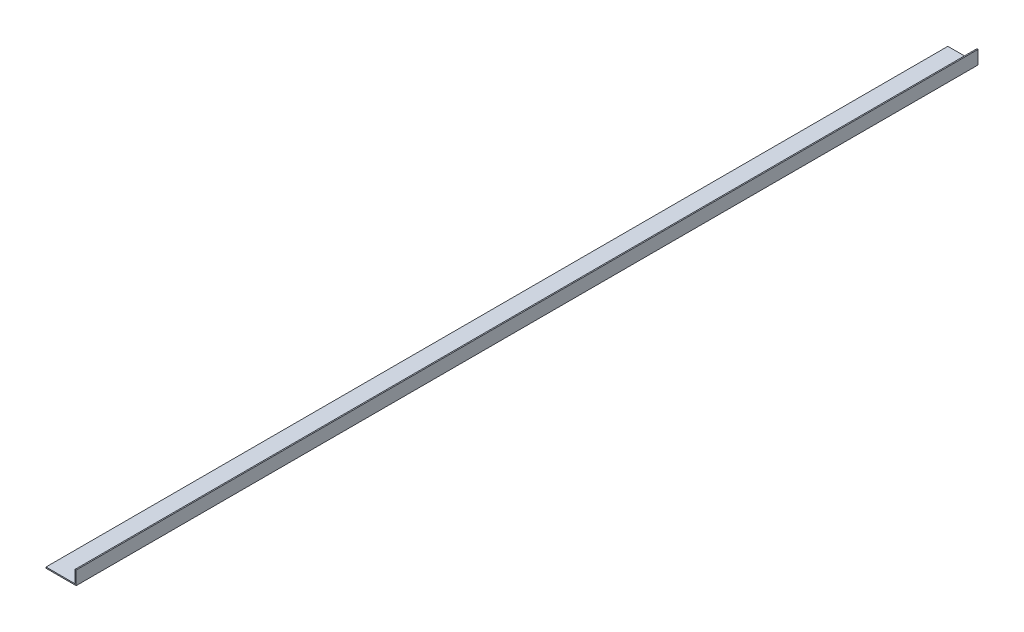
ISO-10303-21;
HEADER;
FILE_DESCRIPTION(('STEP AP214'),'2;1');
FILE_NAME('part.step','',(''),(''),'','','');
FILE_SCHEMA(('AUTOMOTIVE_DESIGN { 1 0 10303 214 1 1 1 1 }'));
ENDSEC;
DATA;
#1=APPLICATION_CONTEXT('core data for automotive mechanical design processes');
#2=APPLICATION_PROTOCOL_DEFINITION('international standard','automotive_design',2000,#1);
#3=PRODUCT_CONTEXT('',#1,'mechanical');
#4=PRODUCT('Part','Part','',(#3));
#5=PRODUCT_RELATED_PRODUCT_CATEGORY('part','',(#4));
#6=PRODUCT_DEFINITION_FORMATION('','',#4);
#7=PRODUCT_DEFINITION_CONTEXT('part definition',#1,'design');
#8=PRODUCT_DEFINITION('design','',#6,#7);
#9=PRODUCT_DEFINITION_SHAPE('','',#8);
#10=(LENGTH_UNIT() NAMED_UNIT(*) SI_UNIT(.MILLI.,.METRE.));
#11=(NAMED_UNIT(*) PLANE_ANGLE_UNIT() SI_UNIT($,.RADIAN.));
#12=(NAMED_UNIT(*) SI_UNIT($,.STERADIAN.) SOLID_ANGLE_UNIT());
#13=UNCERTAINTY_MEASURE_WITH_UNIT(LENGTH_MEASURE(1.E-05),#10,'distance_accuracy_value','');
#14=(GEOMETRIC_REPRESENTATION_CONTEXT(3) GLOBAL_UNCERTAINTY_ASSIGNED_CONTEXT((#13)) GLOBAL_UNIT_ASSIGNED_CONTEXT((#10,
#11,#12)) REPRESENTATION_CONTEXT('',''));
#15=CARTESIAN_POINT('',(0.,0.,0.));
#16=DIRECTION('',(0.,0.,1.));
#17=DIRECTION('',(1.,0.,0.));
#18=AXIS2_PLACEMENT_3D('',#15,#16,#17);
#19=CARTESIAN_POINT('',(15.0000000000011,3937.35292152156,-1196.56406460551));
#20=DIRECTION('',(0.,-1.,0.));
#21=DIRECTION('',(0.,0.,-1.));
#22=AXIS2_PLACEMENT_3D('',#19,#20,#21);
#23=PLANE('',#22);
#24=DIRECTION('',(1.,0.,0.));
#25=VECTOR('',#24,1.);
#26=CARTESIAN_POINT('',(15.0000000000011,3937.35292152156,0.));
#27=LINE('',#26,#25);
#28=CARTESIAN_POINT('',(15.0000000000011,3937.35292152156,0.));
#29=VERTEX_POINT('',#28);
#30=CARTESIAN_POINT('',(55.,3937.35292152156,0.));
#31=VERTEX_POINT('',#30);
#32=EDGE_CURVE('E78',#29,#31,#27,.T.);
#33=ORIENTED_EDGE('',*,*,#32,.F.);
#34=DIRECTION('',(0.,0.,1.));
#35=VECTOR('',#34,1.);
#36=CARTESIAN_POINT('',(15.0000000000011,3937.35292152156,-1196.56406460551));
#37=LINE('',#36,#35);
#38=CARTESIAN_POINT('',(15.0000000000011,3937.35292152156,-1196.56406460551));
#39=VERTEX_POINT('',#38);
#40=EDGE_CURVE('E11',#39,#29,#37,.T.);
#41=ORIENTED_EDGE('',*,*,#40,.F.);
#42=DIRECTION('',(1.,0.,0.));
#43=VECTOR('',#42,1.);
#44=CARTESIAN_POINT('',(15.0000000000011,3937.35292152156,-1196.56406460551));
#45=LINE('',#44,#43);
#46=CARTESIAN_POINT('',(55.,3937.35292152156,-1196.56406460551));
#47=VERTEX_POINT('',#46);
#48=EDGE_CURVE('E80',#39,#47,#45,.T.);
#49=ORIENTED_EDGE('',*,*,#48,.T.);
#50=DIRECTION('',(0.,0.,1.));
#51=VECTOR('',#50,1.);
#52=CARTESIAN_POINT('',(55.,3937.35292152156,-1196.56406460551));
#53=LINE('',#52,#51);
#54=EDGE_CURVE('E29',#47,#31,#53,.T.);
#55=ORIENTED_EDGE('',*,*,#54,.T.);
#56=EDGE_LOOP('',(#33,#41,#49,#55));
#57=FACE_BOUND('',#56,.T.);
#58=ADVANCED_FACE('F26',(#57),#23,.T.);
#59=CARTESIAN_POINT('',(15.0000000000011,3937.35292152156,-1196.56406460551));
#60=DIRECTION('',(-1.,0.,0.));
#61=DIRECTION('',(0.,0.,1.));
#62=AXIS2_PLACEMENT_3D('',#59,#60,#61);
#63=PLANE('',#62);
#64=DIRECTION('',(0.,-1.,0.));
#65=VECTOR('',#64,1.);
#66=CARTESIAN_POINT('',(15.0000000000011,3937.35292152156,0.));
#67=LINE('',#66,#65);
#68=CARTESIAN_POINT('',(15.0000000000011,3938.85292152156,0.));
#69=VERTEX_POINT('',#68);
#70=EDGE_CURVE('E96',#69,#29,#67,.T.);
#71=ORIENTED_EDGE('',*,*,#70,.F.);
#72=DIRECTION('',(0.,0.,1.));
#73=VECTOR('',#72,1.);
#74=CARTESIAN_POINT('',(15.0000000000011,3938.85292152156,-1196.56406460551));
#75=LINE('',#74,#73);
#76=CARTESIAN_POINT('',(15.0000000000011,3938.85292152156,-1196.56406460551));
#77=VERTEX_POINT('',#76);
#78=EDGE_CURVE('E34',#77,#69,#75,.T.);
#79=ORIENTED_EDGE('',*,*,#78,.F.);
#80=DIRECTION('',(0.,-1.,0.));
#81=VECTOR('',#80,1.);
#82=CARTESIAN_POINT('',(15.0000000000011,3937.35292152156,-1196.56406460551));
#83=LINE('',#82,#81);
#84=EDGE_CURVE('E85',#77,#39,#83,.T.);
#85=ORIENTED_EDGE('',*,*,#84,.T.);
#86=ORIENTED_EDGE('',*,*,#40,.T.);
#87=EDGE_LOOP('',(#71,#79,#85,#86));
#88=FACE_BOUND('',#87,.T.);
#89=ADVANCED_FACE('F131',(#88),#63,.T.);
#90=CARTESIAN_POINT('',(15.0000000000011,3938.85292152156,-1196.56406460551));
#91=DIRECTION('',(0.,1.,0.));
#92=DIRECTION('',(0.,0.,1.));
#93=AXIS2_PLACEMENT_3D('',#90,#91,#92);
#94=PLANE('',#93);
#95=DIRECTION('',(-1.,0.,0.));
#96=VECTOR('',#95,1.);
#97=CARTESIAN_POINT('',(15.0000000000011,3938.85292152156,0.));
#98=LINE('',#97,#96);
#99=CARTESIAN_POINT('',(53.4999999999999,3938.85292152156,0.));
#100=VERTEX_POINT('',#99);
#101=EDGE_CURVE('E103',#100,#69,#98,.T.);
#102=ORIENTED_EDGE('',*,*,#101,.F.);
#103=DIRECTION('',(0.,0.,1.));
#104=VECTOR('',#103,1.);
#105=CARTESIAN_POINT('',(53.4999999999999,3938.85292152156,-1196.56406460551));
#106=LINE('',#105,#104);
#107=CARTESIAN_POINT('',(53.4999999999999,3938.85292152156,-1196.56406460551));
#108=VERTEX_POINT('',#107);
#109=EDGE_CURVE('E119',#108,#100,#106,.T.);
#110=ORIENTED_EDGE('',*,*,#109,.F.);
#111=DIRECTION('',(-1.,0.,0.));
#112=VECTOR('',#111,1.);
#113=CARTESIAN_POINT('',(15.0000000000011,3938.85292152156,-1196.56406460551));
#114=LINE('',#113,#112);
#115=EDGE_CURVE('E115',#108,#77,#114,.T.);
#116=ORIENTED_EDGE('',*,*,#115,.T.);
#117=ORIENTED_EDGE('',*,*,#78,.T.);
#118=EDGE_LOOP('',(#102,#110,#116,#117));
#119=FACE_BOUND('',#118,.T.);
#120=ADVANCED_FACE('F136',(#119),#94,.T.);
#121=CARTESIAN_POINT('',(53.4999999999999,3938.85292152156,-1196.56406460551));
#122=DIRECTION('',(-1.,0.,0.));
#123=DIRECTION('',(0.,0.,1.));
#124=AXIS2_PLACEMENT_3D('',#121,#122,#123);
#125=PLANE('',#124);
#126=DIRECTION('',(0.,-1.,0.));
#127=VECTOR('',#126,1.);
#128=CARTESIAN_POINT('',(53.4999999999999,3938.85292152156,0.));
#129=LINE('',#128,#127);
#130=CARTESIAN_POINT('',(53.4999999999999,3955.35292152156,0.));
#131=VERTEX_POINT('',#130);
#132=EDGE_CURVE('E100',#131,#100,#129,.T.);
#133=ORIENTED_EDGE('',*,*,#132,.F.);
#134=DIRECTION('',(0.,0.,1.));
#135=VECTOR('',#134,1.);
#136=CARTESIAN_POINT('',(53.4999999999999,3955.35292152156,-1196.56406460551));
#137=LINE('',#136,#135);
#138=CARTESIAN_POINT('',(53.4999999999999,3955.35292152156,-1196.56406460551));
#139=VERTEX_POINT('',#138);
#140=EDGE_CURVE('E121',#139,#131,#137,.T.);
#141=ORIENTED_EDGE('',*,*,#140,.F.);
#142=DIRECTION('',(0.,-1.,0.));
#143=VECTOR('',#142,1.);
#144=CARTESIAN_POINT('',(53.4999999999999,3938.85292152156,-1196.56406460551));
#145=LINE('',#144,#143);
#146=EDGE_CURVE('E112',#139,#108,#145,.T.);
#147=ORIENTED_EDGE('',*,*,#146,.T.);
#148=ORIENTED_EDGE('',*,*,#109,.T.);
#149=EDGE_LOOP('',(#133,#141,#147,#148));
#150=FACE_BOUND('',#149,.T.);
#151=ADVANCED_FACE('F128',(#150),#125,.T.);
#152=CARTESIAN_POINT('',(53.4999999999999,3955.35292152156,-1196.56406460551));
#153=DIRECTION('',(-2.96059473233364E-13,1.,0.));
#154=DIRECTION('',(-1.,-2.96059473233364E-13,0.));
#155=AXIS2_PLACEMENT_3D('',#152,#153,#154);
#156=PLANE('',#155);
#157=DIRECTION('',(-1.,-2.96059473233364E-13,0.));
#158=VECTOR('',#157,1.);
#159=CARTESIAN_POINT('',(53.4999999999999,3955.35292152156,0.));
#160=LINE('',#159,#158);
#161=CARTESIAN_POINT('',(55.,3955.35292152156,0.));
#162=VERTEX_POINT('',#161);
#163=EDGE_CURVE('E92',#162,#131,#160,.T.);
#164=ORIENTED_EDGE('',*,*,#163,.F.);
#165=DIRECTION('',(0.,0.,1.));
#166=VECTOR('',#165,1.);
#167=CARTESIAN_POINT('',(55.,3955.35292152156,-1196.56406460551));
#168=LINE('',#167,#166);
#169=CARTESIAN_POINT('',(55.,3955.35292152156,-1196.56406460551));
#170=VERTEX_POINT('',#169);
#171=EDGE_CURVE('E84',#170,#162,#168,.T.);
#172=ORIENTED_EDGE('',*,*,#171,.F.);
#173=DIRECTION('',(-1.,-2.96059473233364E-13,0.));
#174=VECTOR('',#173,1.);
#175=CARTESIAN_POINT('',(53.4999999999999,3955.35292152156,-1196.56406460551));
#176=LINE('',#175,#174);
#177=EDGE_CURVE('E109',#170,#139,#176,.T.);
#178=ORIENTED_EDGE('',*,*,#177,.T.);
#179=ORIENTED_EDGE('',*,*,#140,.T.);
#180=EDGE_LOOP('',(#164,#172,#178,#179));
#181=FACE_BOUND('',#180,.T.);
#182=ADVANCED_FACE('F124',(#181),#156,.T.);
#183=CARTESIAN_POINT('',(55.,3937.35292152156,-1196.56406460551));
#184=DIRECTION('',(1.,0.,0.));
#185=DIRECTION('',(0.,1.,0.));
#186=AXIS2_PLACEMENT_3D('',#183,#184,#185);
#187=PLANE('',#186);
#188=DIRECTION('',(0.,1.,0.));
#189=VECTOR('',#188,1.);
#190=CARTESIAN_POINT('',(55.,3937.35292152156,0.));
#191=LINE('',#190,#189);
#192=EDGE_CURVE('E87',#31,#162,#191,.T.);
#193=ORIENTED_EDGE('',*,*,#192,.F.);
#194=ORIENTED_EDGE('',*,*,#54,.F.);
#195=DIRECTION('',(0.,1.,0.));
#196=VECTOR('',#195,1.);
#197=CARTESIAN_POINT('',(55.,3937.35292152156,-1196.56406460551));
#198=LINE('',#197,#196);
#199=EDGE_CURVE('E107',#47,#170,#198,.T.);
#200=ORIENTED_EDGE('',*,*,#199,.T.);
#201=ORIENTED_EDGE('',*,*,#171,.T.);
#202=EDGE_LOOP('',(#193,#194,#200,#201));
#203=FACE_BOUND('',#202,.T.);
#204=ADVANCED_FACE('F88',(#203),#187,.T.);
#205=CARTESIAN_POINT('',(53.4999999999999,3937.35292152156,-1196.56406460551));
#206=DIRECTION('',(0.,0.,1.));
#207=DIRECTION('',(1.,0.,0.));
#208=AXIS2_PLACEMENT_3D('',#205,#206,#207);
#209=PLANE('',#208);
#210=ORIENTED_EDGE('',*,*,#48,.F.);
#211=ORIENTED_EDGE('',*,*,#84,.F.);
#212=ORIENTED_EDGE('',*,*,#115,.F.);
#213=ORIENTED_EDGE('',*,*,#146,.F.);
#214=ORIENTED_EDGE('',*,*,#177,.F.);
#215=ORIENTED_EDGE('',*,*,#199,.F.);
#216=EDGE_LOOP('',(#210,#211,#212,#213,#214,#215));
#217=FACE_BOUND('',#216,.T.);
#218=ADVANCED_FACE('F135',(#217),#209,.F.);
#219=CARTESIAN_POINT('',(53.4999999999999,3937.35292152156,0.));
#220=DIRECTION('',(0.,0.,1.));
#221=DIRECTION('',(1.,0.,0.));
#222=AXIS2_PLACEMENT_3D('',#219,#220,#221);
#223=PLANE('',#222);
#224=ORIENTED_EDGE('',*,*,#32,.T.);
#225=ORIENTED_EDGE('',*,*,#192,.T.);
#226=ORIENTED_EDGE('',*,*,#163,.T.);
#227=ORIENTED_EDGE('',*,*,#132,.T.);
#228=ORIENTED_EDGE('',*,*,#101,.T.);
#229=ORIENTED_EDGE('',*,*,#70,.T.);
#230=EDGE_LOOP('',(#224,#225,#226,#227,#228,#229));
#231=FACE_BOUND('',#230,.T.);
#232=ADVANCED_FACE('F94',(#231),#223,.T.);
#233=CLOSED_SHELL('',(#58,#89,#120,#151,#182,#204,#218,#232));
#234=MANIFOLD_SOLID_BREP('B2',#233);
#235=ADVANCED_BREP_SHAPE_REPRESENTATION('',(#18,#234),#14);
#236=SHAPE_DEFINITION_REPRESENTATION(#9,#235);
ENDSEC;
END-ISO-10303-21;
